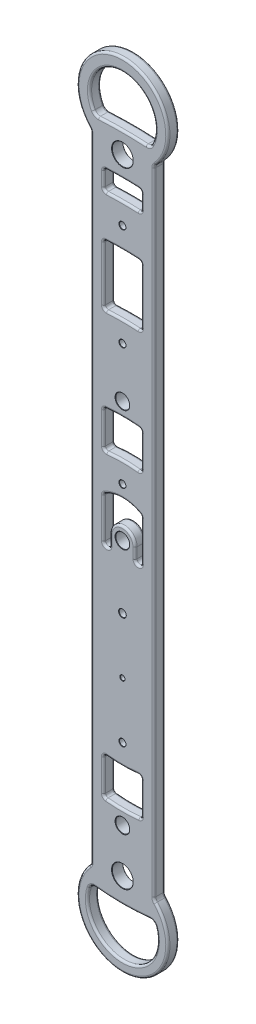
from build123d import *

# Parameters (mm, degrees)
SKETCH_1_R      = 4.55
SKETCH_1_R_2    = 10
SKETCH_1_R_3    = 15
SKETCH_1_R_4    = 3.175
SKETCH_1_R_5    = 5.05
EXTRUDE_1_DEPTH = 16
CHAMFER_1_SIZE  = 0.5
FILLET_1_R      = 3


with BuildPart() as part:
    # Sketch 1 → Extrude 1 (new body)
    with BuildSketch(Plane.XY):
        with BuildLine():
            Line((-45, 732.800398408), (-45, -169.800398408))
            ThreePointArc((-45, -169.800398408), (-45.568117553, -172.761331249), (-47.191780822, -175.30172461))
            ThreePointArc((-47.191780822, -175.30172461), (0, -285), (47.191780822, -175.30172461))
            ThreePointArc((47.191780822, -175.30172461), (45.568117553, -172.761331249), (45, -169.800398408))
            Line((45, -169.800398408), (45, 732.800398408))
            ThreePointArc((45, 732.800398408), (45.568117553, 735.761331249), (47.191780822, 738.30172461))
            ThreePointArc((47.191780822, 738.30172461), (0, 848), (-47.191780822, 738.30172461))
            ThreePointArc((-47.191780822, 738.30172461), (-45.568117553, 735.761331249), (-45, 732.800398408))
        make_face()
        Circle(SKETCH_1_R, mode=Mode.SUBTRACT)
        with Locations((0, -102.5)):
            Circle(SKETCH_1_R_2, mode=Mode.SUBTRACT)
        with Locations((0, -165)):
            Circle(SKETCH_1_R_3, mode=Mode.SUBTRACT)
        with Locations((0, 80)):
            Circle(SKETCH_1_R_4, mode=Mode.SUBTRACT)
        with Locations((0, 160)):
            Circle(SKETCH_1_R_5, mode=Mode.SUBTRACT)
        with Locations((0, 250)):
            Circle(SKETCH_1_R_2, mode=Mode.SUBTRACT)
        with Locations((0, 320)):
            Circle(SKETCH_1_R, mode=Mode.SUBTRACT)
        with Locations((0, 422.5)):
            Circle(SKETCH_1_R_2, mode=Mode.SUBTRACT)
        with Locations((0, 494)):
            Circle(SKETCH_1_R, mode=Mode.SUBTRACT)
        with Locations((0, 640)):
            Circle(SKETCH_1_R, mode=Mode.SUBTRACT)
        with Locations((0, 728)):
            Circle(SKETCH_1_R_3, mode=Mode.SUBTRACT)
        with BuildLine():
            Line((-27, 693.667102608), (-27, 673.602768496))
            ThreePointArc((-27, 673.602768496), (-25.764435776, 670.711766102), (-22.82105258, 669.606773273))
            ThreePointArc((-22.82105258, 669.606773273), (0, 670.1175), (22.82105258, 669.606773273))
            ThreePointArc((22.82105258, 669.606773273), (25.764435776, 670.711766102), (27, 673.602768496))
            Line((27, 673.602768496), (27, 693.667102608))
            ThreePointArc((27, 693.667102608), (25.888678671, 696.433966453), (23.172232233, 697.663392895))
            ThreePointArc((23.172232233, 697.663392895), (0, 698.1625), (-23.172232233, 697.663392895))
            ThreePointArc((-23.172232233, 697.663392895), (-25.888678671, 696.433966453), (-27, 693.667102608))
        make_face(mode=Mode.SUBTRACT)
        with BuildLine():
            Line((-18, 250), (-18, 235))
            ThreePointArc((-18, 235), (-22.5, 230.5), (-27, 235))
            Line((-27, 235), (-27, 292.130748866))
            ThreePointArc((-27, 292.130748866), (-26.43996124, 294.171990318), (-24.916666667, 295.641644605))
            ThreePointArc((-24.916666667, 295.641644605), (0, 302), (24.916666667, 295.641644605))
            ThreePointArc((24.916666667, 295.641644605), (26.43996124, 294.171990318), (27, 292.130748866))
            Line((27, 292.130748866), (27, 235))
            ThreePointArc((27, 235), (22.5, 230.5), (18, 235))
            Line((18, 235), (18, 250))
            ThreePointArc((18, 250), (0, 268), (-18, 250))
        make_face(mode=Mode.SUBTRACT)
        with BuildLine():
            Line((-27, -32.247054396), (-27, -77.639564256))
            ThreePointArc((-27, -77.639564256), (-25.961533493, -80.328303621), (-23.385340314, -81.620960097))
            ThreePointArc((-23.385340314, -81.620960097), (0, -82.75), (23.385340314, -81.620960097))
            ThreePointArc((23.385340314, -81.620960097), (25.961533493, -80.328303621), (27, -77.639564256))
            Line((27, -77.639564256), (27, -32.247054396))
            ThreePointArc((27, -32.247054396), (25.655122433, -29.255345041), (22.524837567, -28.275377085))
            ThreePointArc((22.524837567, -28.275377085), (0, -29.618), (-22.524837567, -28.275377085))
            ThreePointArc((-22.524837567, -28.275377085), (-25.655122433, -29.255345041), (-27, -32.247054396))
        make_face(mode=Mode.SUBTRACT)
        with BuildLine():
            Line((27, 397.639564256), (27, 352.247054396))
            ThreePointArc((27, 352.247054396), (25.655122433, 349.255345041), (22.524837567, 348.275377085))
            ThreePointArc((22.524837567, 348.275377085), (0, 349.618), (-22.524837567, 348.275377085))
            ThreePointArc((-22.524837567, 348.275377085), (-25.655122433, 349.255345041), (-27, 352.247054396))
            Line((-27, 352.247054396), (-27, 397.639564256))
            ThreePointArc((-27, 397.639564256), (-25.961533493, 400.328303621), (-23.385340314, 401.620960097))
            ThreePointArc((-23.385340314, 401.620960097), (0, 402.75), (23.385340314, 401.620960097))
            ThreePointArc((23.385340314, 401.620960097), (25.961533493, 400.328303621), (27, 397.639564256))
        make_face(mode=Mode.SUBTRACT)
        with BuildLine():
            Line((-27, 605.156222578), (-27, 527.030056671))
            ThreePointArc((-27, 527.030056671), (-25.738550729, 524.114522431), (-22.749830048, 523.037887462))
            ThreePointArc((-22.749830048, 523.037887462), (0, 523.75), (22.749830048, 523.037887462))
            ThreePointArc((22.749830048, 523.037887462), (25.738550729, 524.114522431), (27, 527.030056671))
            Line((27, 527.030056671), (27, 605.156222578))
            ThreePointArc((27, 605.156222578), (25.900480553, 607.910712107), (23.206393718, 609.150894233))
            ThreePointArc((23.206393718, 609.150894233), (0, 609.75), (-23.206393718, 609.150894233))
            ThreePointArc((-23.206393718, 609.150894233), (-25.900480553, 607.910712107), (-27, 605.156222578))
        make_face(mode=Mode.SUBTRACT)
        with BuildLine():
            ThreePointArc((41.701691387, 761.321233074), (0, 830), (-41.701691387, 761.321233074))
            ThreePointArc((-41.701691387, 761.321233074), (-38.558630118, 758.05730238), (-34.146718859, 757.024288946))
            ThreePointArc((-34.146718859, 757.024288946), (0, 758), (34.146718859, 757.024288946))
            ThreePointArc((34.146718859, 757.024288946), (38.558630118, 758.05730238), (41.701691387, 761.321233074))
        make_face(mode=Mode.SUBTRACT)
        with BuildLine():
            ThreePointArc((-47.440252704, -204.206886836), (0, -270), (47.440252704, -204.206886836))
            ThreePointArc((47.440252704, -204.206886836), (44.17088971, -200.001156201), (38.985607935, -198.780599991))
            ThreePointArc((38.985607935, -198.780599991), (0, -200.8925), (-38.985607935, -198.780599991))
            ThreePointArc((-38.985607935, -198.780599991), (-44.17088971, -200.001156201), (-47.440252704, -204.206886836))
        make_face(mode=Mode.SUBTRACT)
    extrude(amount=EXTRUDE_1_DEPTH)

    # Chamfer 1
    chamfer_1_edges = [part.edges().sort_by_distance(p)[0] for p in [
        (-4.55, 0, 0),
        (-4.55, 0, 16),
        (-10, -102.5, 0),
        (-10, -102.5, 16),
        (-15, -165, 0),
        (-15, -165, 16),
        (-3.175, 80, 0),
        (-3.175, 80, 16),
        (-5.05, 160, 0),
        (-5.05, 160, 16),
        (-10, 250, 0),
        (-10, 250, 16),
        (-4.55, 320, 0),
        (-4.55, 320, 16),
        (-10, 422.5, 0),
        (-10, 422.5, 16),
        (-4.55, 494, 0),
        (-4.55, 494, 16),
        (-4.55, 640, 0),
        (-4.55, 640, 16),
        (-15, 728, 0),
        (-15, 728, 16),
    ]]
    chamfer(chamfer_1_edges, length=CHAMFER_1_SIZE)

    # Fillet 1
    fillet_1_edges = [part.edges().sort_by_distance(p)[0] for p in [
        (45.568117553, -172.761331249, 16),
        (0, -285, 0),
        (-45.568117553, -172.761331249, 0),
        (38.558630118, 758.05730238, 0),
        (0, 830, 0),
        (-38.558630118, 758.05730238, 0),
        (0, 758, 0),
        (38.558630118, 758.05730238, 16),
        (0, 830, 16),
        (-38.558630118, 758.05730238, 16),
        (0, 758, 16),
        (25.888678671, 696.433966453, 0),
        (0, 698.1625, 0),
        (-25.888678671, 696.433966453, 0),
        (-27, 683.634935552, 0),
        (-25.764435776, 670.711766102, 0),
        (0, 670.1175, 0),
        (25.764435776, 670.711766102, 0),
        (27, 683.634935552, 0),
        (25.888678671, 696.433966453, 16),
        (0, 698.1625, 16),
        (-25.888678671, 696.433966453, 16),
        (-27, 683.634935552, 16),
        (-25.764435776, 670.711766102, 16),
        (0, 670.1175, 16),
        (25.764435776, 670.711766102, 16),
        (27, 683.634935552, 16),
        (45, 281.5, 16),
        (25.900480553, 607.910712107, 0),
        (0, 609.75, 0),
        (-25.900480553, 607.910712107, 0),
        (-27, 566.093139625, 0),
        (-25.738550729, 524.114522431, 0),
        (0, 523.75, 0),
        (25.738550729, 524.114522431, 0),
        (27, 566.093139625, 0),
        (25.900480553, 607.910712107, 16),
        (0, 609.75, 16),
        (-25.900480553, 607.910712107, 16),
        (-27, 566.093139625, 16),
        (-25.738550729, 524.114522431, 16),
        (0, 523.75, 16),
        (25.738550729, 524.114522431, 16),
        (27, 566.093139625, 16),
        (45.568117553, 735.761331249, 16),
        (-25.961533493, 400.328303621, 0),
        (-27, 374.943309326, 0),
        (-25.655122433, 349.255345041, 0),
        (0, 349.618, 0),
        (25.655122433, 349.255345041, 0),
        (27, 374.943309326, 0),
        (25.961533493, 400.328303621, 0),
        (0, 402.75, 0),
        (-25.961533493, 400.328303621, 16),
        (-27, 374.943309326, 16),
        (-25.655122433, 349.255345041, 16),
        (0, 349.618, 16),
        (25.655122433, 349.255345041, 16),
        (27, 374.943309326, 16),
        (25.961533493, 400.328303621, 16),
        (0, 402.75, 16),
        (0, 848, 16),
        (25.655122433, -29.255345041, 0),
        (0, -29.618, 0),
        (-25.655122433, -29.255345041, 0),
        (-27, -54.943309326, 0),
        (-25.961533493, -80.328303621, 0),
        (0, -82.75, 0),
        (25.961533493, -80.328303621, 0),
        (27, -54.943309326, 0),
        (25.655122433, -29.255345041, 16),
        (0, -29.618, 16),
        (-25.655122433, -29.255345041, 16),
        (-27, -54.943309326, 16),
        (-25.961533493, -80.328303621, 16),
        (0, -82.75, 16),
        (25.961533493, -80.328303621, 16),
        (27, -54.943309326, 16),
        (-45.568117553, 735.761331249, 16),
        (-45, 281.5, 16),
        (-45.568117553, -172.761331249, 16),
        (0, -285, 16),
        (0, 268, 0),
        (18, 242.5, 0),
        (22.5, 230.5, 0),
        (27, 263.565374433, 0),
        (26.43996124, 294.171990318, 0),
        (0, 302, 0),
        (-26.43996124, 294.171990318, 0),
        (-27, 263.565374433, 0),
        (-22.5, 230.5, 0),
        (-18, 242.5, 0),
        (0, 268, 16),
        (18, 242.5, 16),
        (22.5, 230.5, 16),
        (27, 263.565374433, 16),
        (26.43996124, 294.171990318, 16),
        (0, 302, 16),
        (-26.43996124, 294.171990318, 16),
        (-27, 263.565374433, 16),
        (-22.5, 230.5, 16),
        (-18, 242.5, 16),
        (-45, 281.5, 0),
        (-45.568117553, 735.761331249, 0),
        (0, 848, 0),
        (45.568117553, 735.761331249, 0),
        (45, 281.5, 0),
        (44.17088971, -200.001156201, 0),
        (0, -200.8925, 0),
        (-44.17088971, -200.001156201, 0),
        (0, -270, 0),
        (44.17088971, -200.001156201, 16),
        (0, -200.8925, 16),
        (-44.17088971, -200.001156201, 16),
        (45.568117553, -172.761331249, 0),
        (0, -270, 16),
    ]]
    fillet(fillet_1_edges, radius=FILLET_1_R)


solid = part.part
